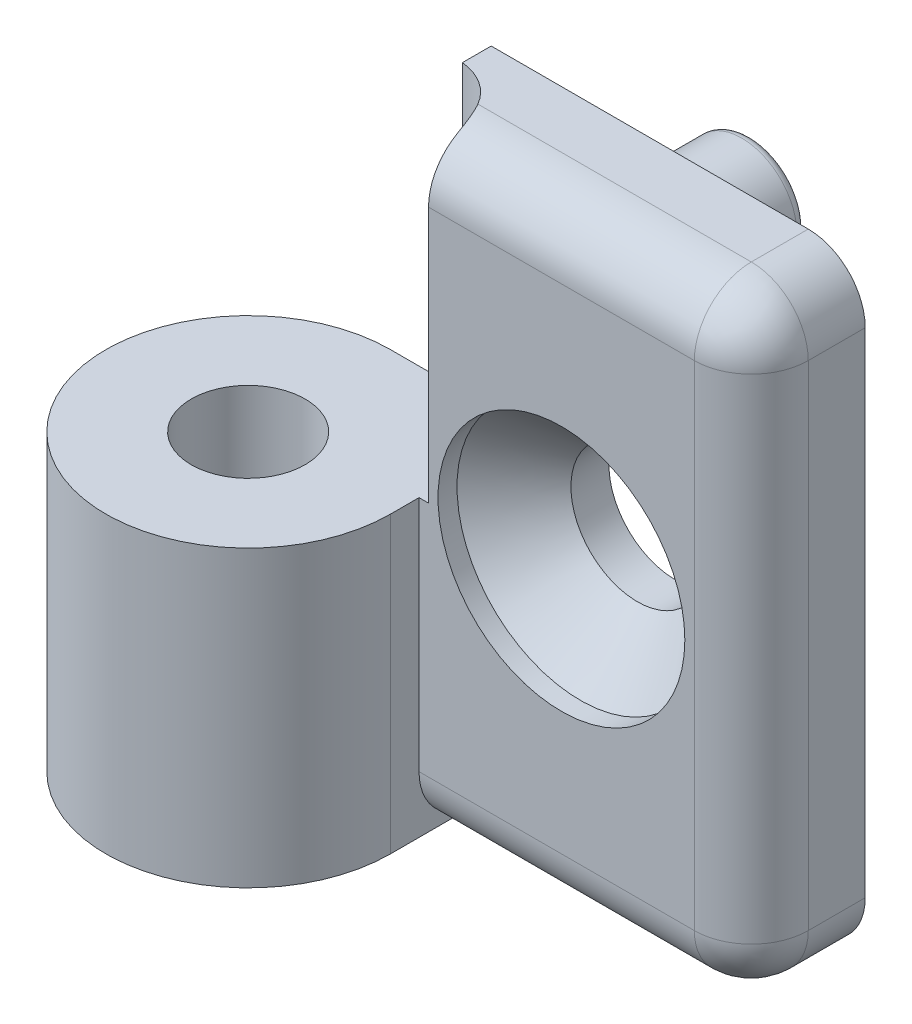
from build123d import *

# Parameters (mm, degrees)
EXTRUDE_1_DEPTH     = 15.5
EXTRUDE_10_DEPTH    = 32
FILLET_1_R          = 3
CUT_EXTRUDE_1_DEPTH = 16.5
SKETCH_10_R         = 3
CUT_EXTRUDE_2_DEPTH = 13.5
SKETCH_8_R          = 2.9
EXTRUDE_1_2_DEPTH   = 4
FILLET_2_R          = 0.5
SKETCH_11_R         = 2
CUT_EXTRUDE_3_DEPTH = 7.5


with BuildPart() as part:
    # Sketch 1 → Extrude 1 (new body)
    with BuildSketch(Plane(origin=(0, 0, 0), x_dir=(1, 0, 0), z_dir=(0, 1, 0))):
        with BuildLine():
            Line((7.6, 7.5), (0, 7.5))
            ThreePointArc((0, 7.5), (-5.303300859, -5.303300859), (7.5, 0))
            Line((7.5, 0), (7.5, 1.5))
            Line((7.5, 1.5), (7.6, 1.5))
            Line((7.6, 1.5), (7.6, 7.5))
        make_face()
    extrude(amount=EXTRUDE_1_DEPTH)

    # Sketch 2 → Extrude 10 (add)
    with BuildSketch(Plane.XZ):
        with BuildLine():
            Line((22, -1.5), (5.3, -1.5))
            Line((5.3, -1.5), (5.3, -7.5))
            Line((5.3, -7.5), (25, -7.5))
            Line((25, -7.5), (25, -4.5))
            ThreePointArc((25, -4.5), (24.121320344, -2.378679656), (22, -1.5))
        make_face()
    extrude(amount=-EXTRUDE_10_DEPTH)

    # Sketch 6 → Hole Wizard 1 (revolve, cut)
    with BuildSketch(Plane(origin=(15, 16, -1.5), x_dir=(0, -1, 0), z_dir=(1, 0, 0))):
        Polygon((0, 0), (0, 6), (3.5, 6), (3.5, 4), (6.5, 1), (6.5, 0), align=None)
    revolve(axis=Axis((15, 16, 4.85), (0, 0, -1)), mode=Mode.SUBTRACT)

    # Fillet 1
    fillet_1_edges = [part.edges().sort_by_distance(p)[0] for p in [
        (24.121320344, 0, -2.378679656),
        (13.65, 32, -1.5),
        (25, 0, -6),
        (24.121320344, 32, -2.378679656),
        (25, 32, -6),
        (14.75, 0, -1.5),
    ]]
    fillet(fillet_1_edges, radius=FILLET_1_R)

    # Sketch 9 → Cut-Extrude 1 (cut)
    with BuildSketch(Plane(origin=(0, 32, 0), x_dir=(1, 0, 0), z_dir=(0, 1, 0))):
        with BuildLine():
            Line((8, 3), (8, 0))
            Line((8, 0), (5, 0))
            ThreePointArc((5, 0), (2.878679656, 5.121320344), (8, 3))
        make_face()
    extrude(amount=-CUT_EXTRUDE_1_DEPTH, mode=Mode.SUBTRACT)

    # Sketch 10 → Cut-Extrude 2 (cut)
    with BuildSketch(Plane(origin=(0, 15.5, 0), x_dir=(1, 0, 0), z_dir=(0, 1, 0))):
        with Locations(Location((0, 0, 0), (0, 0, 270))):
            Circle(SKETCH_10_R)
    extrude(amount=-CUT_EXTRUDE_2_DEPTH, mode=Mode.SUBTRACT)

    # Sketch 8 → Extrude 1 2 (add)
    with BuildSketch(Plane(origin=(0, 0, -7.5), x_dir=(-1, 0, 0), z_dir=(0, 0, -1))):
        with Locations(Location((-15, 4, 0), (0, 0, 180))):
            Circle(SKETCH_8_R)
        with Locations(Location((-15, 28, 0), (0, 0, 180))):
            Circle(SKETCH_8_R)
    extrude(amount=EXTRUDE_1_2_DEPTH)

    # Fillet 2
    fillet_2_edges = [part.edges().sort_by_distance(p)[0] for p in [
        (12.1, 4, -11.5),
        (12.1, 28, -11.5),
    ]]
    fillet(fillet_2_edges, radius=FILLET_2_R)

    # Sketch 11 → Cut-Extrude 3 (cut)
    with BuildSketch(Plane(origin=(0, 0, -11.5), x_dir=(-1, 0, 0), z_dir=(0, 0, -1))):
        with Locations((-15, 28)):
            Circle(SKETCH_11_R)
        with Locations((-15, 4)):
            Circle(SKETCH_11_R)
    extrude(amount=-CUT_EXTRUDE_3_DEPTH, mode=Mode.SUBTRACT)


solid = part.part
